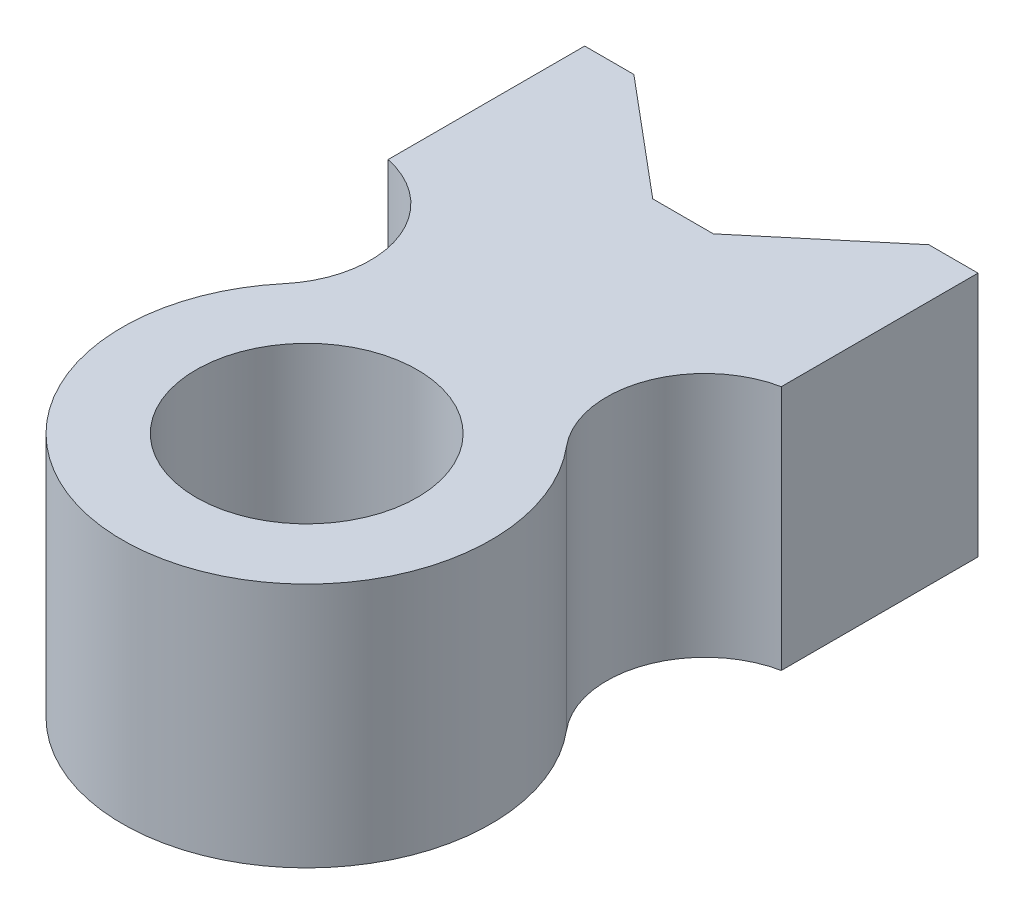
from build123d import *

# Parameters (mm, degrees)
CROQUIS2_R              = 22.5
SALIENTE_EXTRUIR1_DEPTH = 50


with BuildPart() as part:
    # Croquis2 → Saliente-Extruir1 (new body)
    with BuildSketch(Plane(origin=(0, 0, 0), x_dir=(1, 0, 0), z_dir=(0, 1, 0))):
        with BuildLine():
            Line((-6.164928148, 76.54643814), (6.164928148, 76.54643814))
            Line((6.164928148, 76.54643814), (30, 96.54643814))
            Line((30, 96.54643814), (40, 96.54643814))
            Line((40, 96.54643814), (40, 56.54643814))
            ThreePointArc((40, 56.54643814), (25.155667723, 43.525085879), (28.726666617, 24.104535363))
            ThreePointArc((28.726666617, 24.104535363), (0, -37.5), (-28.726666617, 24.104535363))
            ThreePointArc((-28.726666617, 24.104535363), (-25.155667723, 43.525085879), (-40, 56.54643814))
            Line((-40, 56.54643814), (-40, 96.54643814))
            Line((-40, 96.54643814), (-30, 96.54643814))
            Line((-30, 96.54643814), (-6.164928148, 76.54643814))
        make_face()
        with Locations(Location((0, 0, 0), (0, 0, 270))):
            Circle(CROQUIS2_R, mode=Mode.SUBTRACT)
    extrude(amount=SALIENTE_EXTRUIR1_DEPTH)


solid = part.part
